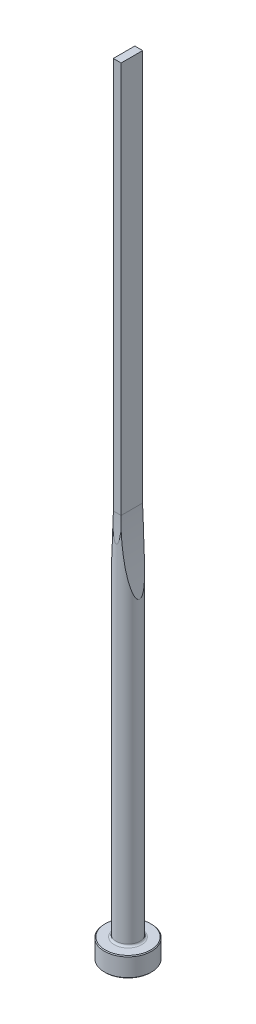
from build123d import *

# Parameters (mm, degrees)
CUT_EXTRUDE1_DEPTH = 5
CUT_EXTRUDE2_DEPTH = 5


with BuildPart() as part:
    # Sketch1 → Revolve1 (revolve)
    with BuildSketch(Plane.XY, mode=Mode.PRIVATE) as revolve1_sk:
        with BuildLine():
            Line((0, 0), (5.8, 0))
            Line((5.8, 0), (6, 0.2))
            Line((6, 0.2), (6, 4.8))
            Line((6, 4.8), (5.8, 5))
            Line((5.8, 5), (3.5, 5))
            ThreePointArc((3.5, 5), (3.146446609, 5.146446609), (3, 5.5))
            Line((3, 5.5), (3, 200))
            Line((3, 200), (0, 200))
            Line((0, 200), (0, 0))
        make_face()
    revolve(revolve1_sk.sketch.rotate(Axis((0, 200, 0), (0, -1, 0)), 180), axis=Axis((0, 200, 0), (0, -1, 0)))

    # Sketch2 → Cut-Extrude1 (cut, symmetric)
    with BuildSketch(Plane.XY):
        with BuildLine():
            Line((1, 200), (1, 100))
            ThreePointArc((1, 100), (1.501396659, 90.513167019), (3, 81.132037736))
            Line((3, 81.132037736), (3, 200))
            Line((3, 200), (1, 200))
        make_face()
        with BuildLine():
            Line((-1, 200), (-1, 100))
            ThreePointArc((-1, 100), (-1.501396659, 90.513167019), (-3, 81.132037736))
            Line((-3, 81.132037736), (-3, 200))
            Line((-3, 200), (-1, 200))
        make_face()
    extrude(amount=CUT_EXTRUDE1_DEPTH, both=True, mode=Mode.SUBTRACT)

    # Sketch3 → Cut-Extrude2 (cut, symmetric)
    with BuildSketch(Plane(origin=(0, 0, 0), x_dir=(0, 0, -1), z_dir=(1, 0, 0))):
        with BuildLine():
            Line((2.75, 200), (2.75, 100))
            ThreePointArc((2.75, 100), (2.812521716, 96.645898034), (3, 93.296456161))
            Line((3, 93.296456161), (3, 200))
            Line((3, 200), (2.75, 200))
        make_face()
        with BuildLine():
            Line((-2.75, 200), (-2.75, 100))
            ThreePointArc((-2.75, 100), (-2.812521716, 96.645898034), (-3, 93.296456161))
            Line((-3, 93.296456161), (-3, 200))
            Line((-3, 200), (-2.75, 200))
        make_face()
    extrude(amount=CUT_EXTRUDE2_DEPTH, both=True, mode=Mode.SUBTRACT)


solid = part.part
